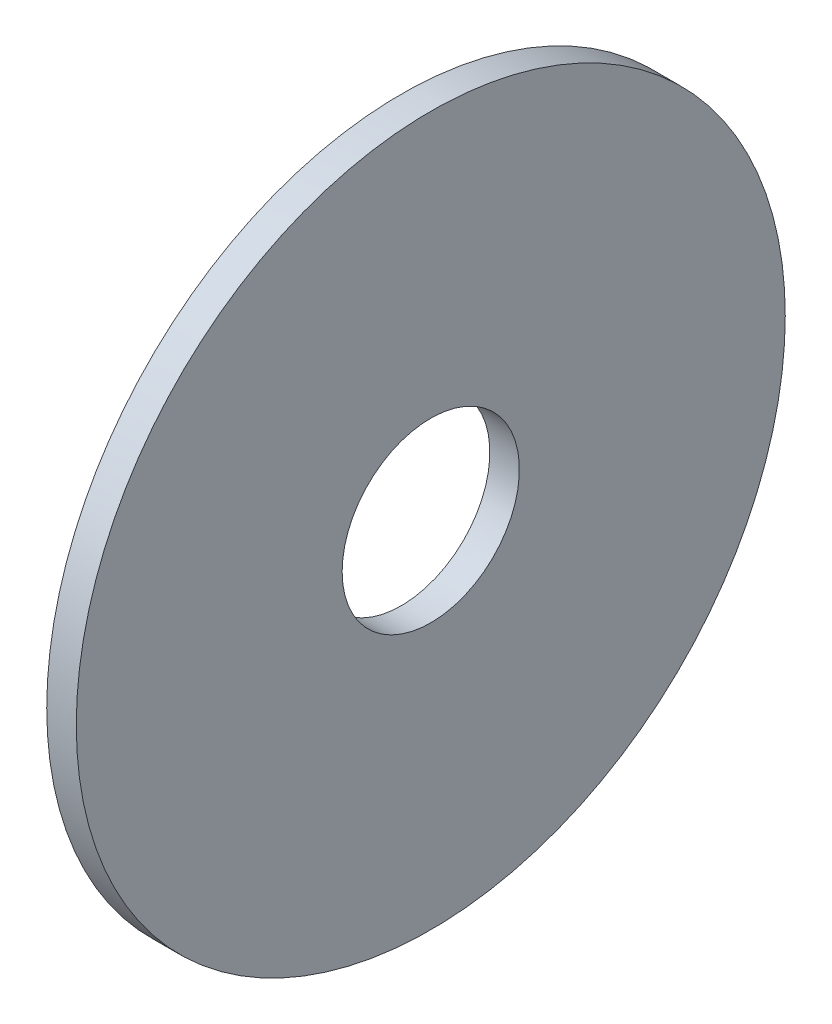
ISO-10303-21;
HEADER;
FILE_DESCRIPTION(('STEP AP214'),'2;1');
FILE_NAME('part.step','',(''),(''),'','','');
FILE_SCHEMA(('AUTOMOTIVE_DESIGN { 1 0 10303 214 1 1 1 1 }'));
ENDSEC;
DATA;
#1=APPLICATION_CONTEXT('core data for automotive mechanical design processes');
#2=APPLICATION_PROTOCOL_DEFINITION('international standard','automotive_design',2000,#1);
#3=PRODUCT_CONTEXT('',#1,'mechanical');
#4=PRODUCT('Part','Part','',(#3));
#5=PRODUCT_RELATED_PRODUCT_CATEGORY('part','',(#4));
#6=PRODUCT_DEFINITION_FORMATION('','',#4);
#7=PRODUCT_DEFINITION_CONTEXT('part definition',#1,'design');
#8=PRODUCT_DEFINITION('design','',#6,#7);
#9=PRODUCT_DEFINITION_SHAPE('','',#8);
#10=(LENGTH_UNIT() NAMED_UNIT(*) SI_UNIT(.MILLI.,.METRE.));
#11=(NAMED_UNIT(*) PLANE_ANGLE_UNIT() SI_UNIT($,.RADIAN.));
#12=(NAMED_UNIT(*) SI_UNIT($,.STERADIAN.) SOLID_ANGLE_UNIT());
#13=UNCERTAINTY_MEASURE_WITH_UNIT(LENGTH_MEASURE(1.E-05),#10,'distance_accuracy_value','');
#14=(GEOMETRIC_REPRESENTATION_CONTEXT(3) GLOBAL_UNCERTAINTY_ASSIGNED_CONTEXT((#13)) GLOBAL_UNIT_ASSIGNED_CONTEXT((#10,
#11,#12)) REPRESENTATION_CONTEXT('',''));
#15=CARTESIAN_POINT('',(0.,0.,0.));
#16=DIRECTION('',(0.,0.,1.));
#17=DIRECTION('',(1.,0.,0.));
#18=AXIS2_PLACEMENT_3D('',#15,#16,#17);
#19=CARTESIAN_POINT('',(0.5,0.,0.));
#20=DIRECTION('',(-1.,0.,0.));
#21=DIRECTION('',(0.,0.,1.));
#22=AXIS2_PLACEMENT_3D('',#19,#20,#21);
#23=CYLINDRICAL_SURFACE('',#22,12.);
#24=CARTESIAN_POINT('',(0.500000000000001,0.,0.));
#25=DIRECTION('',(-1.,0.,0.));
#26=DIRECTION('',(0.,0.,1.));
#27=AXIS2_PLACEMENT_3D('',#24,#25,#26);
#28=CIRCLE('',#27,12.);
#29=CARTESIAN_POINT('',(0.500000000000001,0.,12.));
#30=VERTEX_POINT('',#29);
#31=EDGE_CURVE('E10',#30,#30,#28,.T.);
#32=ORIENTED_EDGE('',*,*,#31,.T.);
#33=EDGE_LOOP('',(#32));
#34=FACE_BOUND('',#33,.T.);
#35=CARTESIAN_POINT('',(-0.5,0.,0.));
#36=DIRECTION('',(-1.,0.,0.));
#37=DIRECTION('',(0.,0.,1.));
#38=AXIS2_PLACEMENT_3D('',#35,#36,#37);
#39=CIRCLE('',#38,12.);
#40=CARTESIAN_POINT('',(-0.5,0.,12.));
#41=VERTEX_POINT('',#40);
#42=EDGE_CURVE('E44',#41,#41,#39,.T.);
#43=ORIENTED_EDGE('',*,*,#42,.F.);
#44=EDGE_LOOP('',(#43));
#45=FACE_BOUND('',#44,.T.);
#46=ADVANCED_FACE('F30',(#34,#45),#23,.T.);
#47=CARTESIAN_POINT('',(0.500000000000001,12.,0.));
#48=DIRECTION('',(1.,0.,0.));
#49=DIRECTION('',(0.,0.,-1.));
#50=AXIS2_PLACEMENT_3D('',#47,#48,#49);
#51=PLANE('',#50);
#52=CARTESIAN_POINT('',(0.5,0.,0.));
#53=DIRECTION('',(-1.,0.,0.));
#54=DIRECTION('',(0.,0.,1.));
#55=AXIS2_PLACEMENT_3D('',#52,#53,#54);
#56=CIRCLE('',#55,3.);
#57=CARTESIAN_POINT('',(0.5,0.,3.));
#58=VERTEX_POINT('',#57);
#59=EDGE_CURVE('E36',#58,#58,#56,.T.);
#60=ORIENTED_EDGE('',*,*,#59,.T.);
#61=EDGE_LOOP('',(#60));
#62=FACE_BOUND('',#61,.T.);
#63=ORIENTED_EDGE('',*,*,#31,.F.);
#64=EDGE_LOOP('',(#63));
#65=FACE_BOUND('',#64,.T.);
#66=ADVANCED_FACE('F54',(#62,#65),#51,.T.);
#67=CARTESIAN_POINT('',(0.5,0.,0.));
#68=DIRECTION('',(-1.,0.,0.));
#69=DIRECTION('',(0.,0.,1.));
#70=AXIS2_PLACEMENT_3D('',#67,#68,#69);
#71=CYLINDRICAL_SURFACE('',#70,3.);
#72=CARTESIAN_POINT('',(-0.5,0.,0.));
#73=DIRECTION('',(-1.,0.,0.));
#74=DIRECTION('',(0.,0.,1.));
#75=AXIS2_PLACEMENT_3D('',#72,#73,#74);
#76=CIRCLE('',#75,3.);
#77=CARTESIAN_POINT('',(-0.5,0.,3.));
#78=VERTEX_POINT('',#77);
#79=EDGE_CURVE('E40',#78,#78,#76,.T.);
#80=ORIENTED_EDGE('',*,*,#79,.T.);
#81=EDGE_LOOP('',(#80));
#82=FACE_BOUND('',#81,.T.);
#83=ORIENTED_EDGE('',*,*,#59,.F.);
#84=EDGE_LOOP('',(#83));
#85=FACE_BOUND('',#84,.T.);
#86=ADVANCED_FACE('F58',(#82,#85),#71,.F.);
#87=CARTESIAN_POINT('',(-0.5,3.,0.));
#88=DIRECTION('',(-1.,0.,0.));
#89=DIRECTION('',(0.,0.,1.));
#90=AXIS2_PLACEMENT_3D('',#87,#88,#89);
#91=PLANE('',#90);
#92=ORIENTED_EDGE('',*,*,#42,.T.);
#93=EDGE_LOOP('',(#92));
#94=FACE_BOUND('',#93,.T.);
#95=ORIENTED_EDGE('',*,*,#79,.F.);
#96=EDGE_LOOP('',(#95));
#97=FACE_BOUND('',#96,.T.);
#98=ADVANCED_FACE('F50',(#94,#97),#91,.T.);
#99=CLOSED_SHELL('',(#46,#66,#86,#98));
#100=MANIFOLD_SOLID_BREP('B2',#99);
#101=ADVANCED_BREP_SHAPE_REPRESENTATION('',(#18,#100),#14);
#102=SHAPE_DEFINITION_REPRESENTATION(#9,#101);
ENDSEC;
END-ISO-10303-21;
